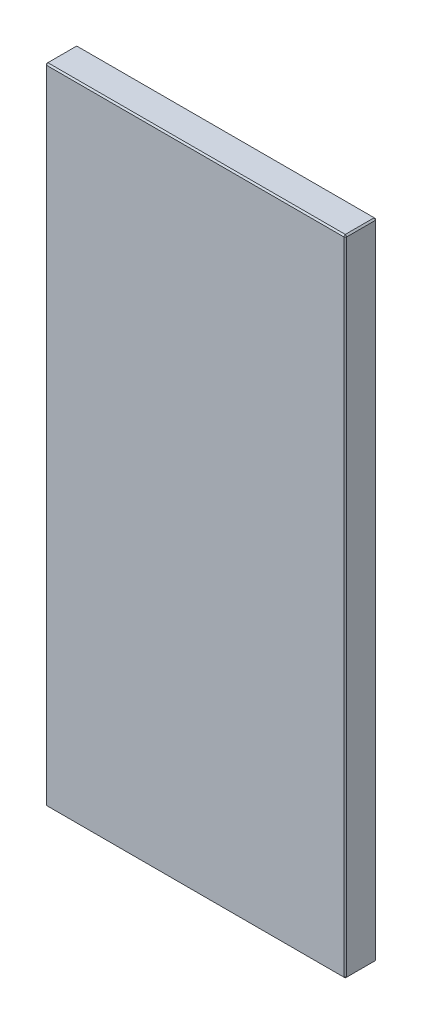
ISO-10303-21;
HEADER;
FILE_DESCRIPTION(('STEP AP214'),'2;1');
FILE_NAME('part.step','',(''),(''),'','','');
FILE_SCHEMA(('AUTOMOTIVE_DESIGN { 1 0 10303 214 1 1 1 1 }'));
ENDSEC;
DATA;
#1=APPLICATION_CONTEXT('core data for automotive mechanical design processes');
#2=APPLICATION_PROTOCOL_DEFINITION('international standard','automotive_design',2000,#1);
#3=PRODUCT_CONTEXT('',#1,'mechanical');
#4=PRODUCT('Part','Part','',(#3));
#5=PRODUCT_RELATED_PRODUCT_CATEGORY('part','',(#4));
#6=PRODUCT_DEFINITION_FORMATION('','',#4);
#7=PRODUCT_DEFINITION_CONTEXT('part definition',#1,'design');
#8=PRODUCT_DEFINITION('design','',#6,#7);
#9=PRODUCT_DEFINITION_SHAPE('','',#8);
#10=(LENGTH_UNIT() NAMED_UNIT(*) SI_UNIT(.MILLI.,.METRE.));
#11=(NAMED_UNIT(*) PLANE_ANGLE_UNIT() SI_UNIT($,.RADIAN.));
#12=(NAMED_UNIT(*) SI_UNIT($,.STERADIAN.) SOLID_ANGLE_UNIT());
#13=UNCERTAINTY_MEASURE_WITH_UNIT(LENGTH_MEASURE(1.E-05),#10,'distance_accuracy_value','');
#14=(GEOMETRIC_REPRESENTATION_CONTEXT(3) GLOBAL_UNCERTAINTY_ASSIGNED_CONTEXT((#13)) GLOBAL_UNIT_ASSIGNED_CONTEXT((#10,
#11,#12)) REPRESENTATION_CONTEXT('',''));
#15=CARTESIAN_POINT('',(0.,0.,0.));
#16=DIRECTION('',(0.,0.,1.));
#17=DIRECTION('',(1.,0.,0.));
#18=AXIS2_PLACEMENT_3D('',#15,#16,#17);
#19=CARTESIAN_POINT('',(-104.,-223.,22.));
#20=DIRECTION('',(1.,0.,0.));
#21=DIRECTION('',(0.,0.,-1.));
#22=AXIS2_PLACEMENT_3D('',#19,#20,#21);
#23=PLANE('',#22);
#24=DIRECTION('',(0.,0.,-1.));
#25=VECTOR('',#24,1.);
#26=CARTESIAN_POINT('',(-104.,222.,22.));
#27=LINE('',#26,#25);
#28=CARTESIAN_POINT('',(-104.,222.,21.));
#29=VERTEX_POINT('',#28);
#30=CARTESIAN_POINT('',(-104.,222.,1.00000000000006));
#31=VERTEX_POINT('',#30);
#32=EDGE_CURVE('E114',#29,#31,#27,.T.);
#33=ORIENTED_EDGE('',*,*,#32,.T.);
#34=DIRECTION('',(0.,-1.,0.));
#35=VECTOR('',#34,1.);
#36=CARTESIAN_POINT('',(-104.,-223.,1.00000000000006));
#37=LINE('',#36,#35);
#38=CARTESIAN_POINT('',(-104.,-222.,1.00000000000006));
#39=VERTEX_POINT('',#38);
#40=EDGE_CURVE('E110',#31,#39,#37,.T.);
#41=ORIENTED_EDGE('',*,*,#40,.T.);
#42=DIRECTION('',(0.,0.,1.));
#43=VECTOR('',#42,1.);
#44=CARTESIAN_POINT('',(-104.,-222.,22.));
#45=LINE('',#44,#43);
#46=CARTESIAN_POINT('',(-104.,-222.,21.));
#47=VERTEX_POINT('',#46);
#48=EDGE_CURVE('E103',#39,#47,#45,.T.);
#49=ORIENTED_EDGE('',*,*,#48,.T.);
#50=DIRECTION('',(0.,1.,0.));
#51=VECTOR('',#50,1.);
#52=CARTESIAN_POINT('',(-104.,223.,21.));
#53=LINE('',#52,#51);
#54=EDGE_CURVE('E107',#47,#29,#53,.T.);
#55=ORIENTED_EDGE('',*,*,#54,.T.);
#56=EDGE_LOOP('',(#33,#41,#49,#55));
#57=FACE_BOUND('',#56,.T.);
#58=ADVANCED_FACE('F15',(#57),#23,.F.);
#59=CARTESIAN_POINT('',(104.,-223.,22.));
#60=DIRECTION('',(0.,1.,0.));
#61=DIRECTION('',(-1.,0.,0.));
#62=AXIS2_PLACEMENT_3D('',#59,#60,#61);
#63=PLANE('',#62);
#64=DIRECTION('',(0.,0.,-1.));
#65=VECTOR('',#64,1.);
#66=CARTESIAN_POINT('',(-103.,-223.,22.));
#67=LINE('',#66,#65);
#68=CARTESIAN_POINT('',(-103.,-223.,21.));
#69=VERTEX_POINT('',#68);
#70=CARTESIAN_POINT('',(-103.,-223.,1.00000000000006));
#71=VERTEX_POINT('',#70);
#72=EDGE_CURVE('E122',#69,#71,#67,.T.);
#73=ORIENTED_EDGE('',*,*,#72,.T.);
#74=DIRECTION('',(1.,0.,0.));
#75=VECTOR('',#74,1.);
#76=CARTESIAN_POINT('',(104.,-223.,1.00000000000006));
#77=LINE('',#76,#75);
#78=CARTESIAN_POINT('',(103.,-223.,1.00000000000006));
#79=VERTEX_POINT('',#78);
#80=EDGE_CURVE('E160',#71,#79,#77,.T.);
#81=ORIENTED_EDGE('',*,*,#80,.T.);
#82=DIRECTION('',(0.,0.,1.));
#83=VECTOR('',#82,1.);
#84=CARTESIAN_POINT('',(103.,-223.,22.));
#85=LINE('',#84,#83);
#86=CARTESIAN_POINT('',(103.,-223.,21.));
#87=VERTEX_POINT('',#86);
#88=EDGE_CURVE('E157',#79,#87,#85,.T.);
#89=ORIENTED_EDGE('',*,*,#88,.T.);
#90=DIRECTION('',(-1.,0.,0.));
#91=VECTOR('',#90,1.);
#92=CARTESIAN_POINT('',(-104.,-223.,21.));
#93=LINE('',#92,#91);
#94=EDGE_CURVE('E155',#87,#69,#93,.T.);
#95=ORIENTED_EDGE('',*,*,#94,.T.);
#96=EDGE_LOOP('',(#73,#81,#89,#95));
#97=FACE_BOUND('',#96,.T.);
#98=ADVANCED_FACE('F277',(#97),#63,.F.);
#99=CARTESIAN_POINT('',(104.,-223.,22.));
#100=DIRECTION('',(-1.,0.,0.));
#101=DIRECTION('',(0.,0.,1.));
#102=AXIS2_PLACEMENT_3D('',#99,#100,#101);
#103=PLANE('',#102);
#104=DIRECTION('',(0.,-1.,0.));
#105=VECTOR('',#104,1.);
#106=CARTESIAN_POINT('',(104.,-223.,21.));
#107=LINE('',#106,#105);
#108=CARTESIAN_POINT('',(104.,222.,21.));
#109=VERTEX_POINT('',#108);
#110=CARTESIAN_POINT('',(104.,-222.,21.));
#111=VERTEX_POINT('',#110);
#112=EDGE_CURVE('E162',#109,#111,#107,.T.);
#113=ORIENTED_EDGE('',*,*,#112,.T.);
#114=DIRECTION('',(0.,0.,-1.));
#115=VECTOR('',#114,1.);
#116=CARTESIAN_POINT('',(104.,-222.,22.));
#117=LINE('',#116,#115);
#118=CARTESIAN_POINT('',(104.,-222.,1.00000000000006));
#119=VERTEX_POINT('',#118);
#120=EDGE_CURVE('E168',#111,#119,#117,.T.);
#121=ORIENTED_EDGE('',*,*,#120,.T.);
#122=DIRECTION('',(0.,1.,0.));
#123=VECTOR('',#122,1.);
#124=CARTESIAN_POINT('',(104.,-223.,1.00000000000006));
#125=LINE('',#124,#123);
#126=CARTESIAN_POINT('',(104.,222.,1.00000000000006));
#127=VERTEX_POINT('',#126);
#128=EDGE_CURVE('E166',#119,#127,#125,.T.);
#129=ORIENTED_EDGE('',*,*,#128,.T.);
#130=DIRECTION('',(0.,0.,1.));
#131=VECTOR('',#130,1.);
#132=CARTESIAN_POINT('',(104.,222.,22.));
#133=LINE('',#132,#131);
#134=EDGE_CURVE('E164',#127,#109,#133,.T.);
#135=ORIENTED_EDGE('',*,*,#134,.T.);
#136=EDGE_LOOP('',(#113,#121,#129,#135));
#137=FACE_BOUND('',#136,.T.);
#138=ADVANCED_FACE('F254',(#137),#103,.F.);
#139=CARTESIAN_POINT('',(104.,223.,22.));
#140=DIRECTION('',(0.,-1.,0.));
#141=DIRECTION('',(1.,0.,0.));
#142=AXIS2_PLACEMENT_3D('',#139,#140,#141);
#143=PLANE('',#142);
#144=DIRECTION('',(-1.,0.,0.));
#145=VECTOR('',#144,1.);
#146=CARTESIAN_POINT('',(104.,223.,1.00000000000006));
#147=LINE('',#146,#145);
#148=CARTESIAN_POINT('',(103.,223.,1.00000000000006));
#149=VERTEX_POINT('',#148);
#150=CARTESIAN_POINT('',(-103.,223.,1.00000000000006));
#151=VERTEX_POINT('',#150);
#152=EDGE_CURVE('E150',#149,#151,#147,.T.);
#153=ORIENTED_EDGE('',*,*,#152,.T.);
#154=DIRECTION('',(0.,0.,1.));
#155=VECTOR('',#154,1.);
#156=CARTESIAN_POINT('',(-103.,223.,22.));
#157=LINE('',#156,#155);
#158=CARTESIAN_POINT('',(-103.,223.,21.));
#159=VERTEX_POINT('',#158);
#160=EDGE_CURVE('E152',#151,#159,#157,.T.);
#161=ORIENTED_EDGE('',*,*,#160,.T.);
#162=DIRECTION('',(1.,0.,0.));
#163=VECTOR('',#162,1.);
#164=CARTESIAN_POINT('',(104.,223.,21.));
#165=LINE('',#164,#163);
#166=CARTESIAN_POINT('',(103.,223.,21.));
#167=VERTEX_POINT('',#166);
#168=EDGE_CURVE('E146',#159,#167,#165,.T.);
#169=ORIENTED_EDGE('',*,*,#168,.T.);
#170=DIRECTION('',(0.,0.,-1.));
#171=VECTOR('',#170,1.);
#172=CARTESIAN_POINT('',(103.,223.,22.));
#173=LINE('',#172,#171);
#174=EDGE_CURVE('E148',#167,#149,#173,.T.);
#175=ORIENTED_EDGE('',*,*,#174,.T.);
#176=EDGE_LOOP('',(#153,#161,#169,#175));
#177=FACE_BOUND('',#176,.T.);
#178=ADVANCED_FACE('F286',(#177),#143,.F.);
#179=CARTESIAN_POINT('',(0.,0.,22.));
#180=DIRECTION('',(0.,0.,1.));
#181=DIRECTION('',(1.,0.,0.));
#182=AXIS2_PLACEMENT_3D('',#179,#180,#181);
#183=PLANE('',#182);
#184=DIRECTION('',(0.,1.,0.));
#185=VECTOR('',#184,1.);
#186=CARTESIAN_POINT('',(103.,223.,22.));
#187=LINE('',#186,#185);
#188=CARTESIAN_POINT('',(103.,-222.,22.));
#189=VERTEX_POINT('',#188);
#190=CARTESIAN_POINT('',(103.,222.,22.));
#191=VERTEX_POINT('',#190);
#192=EDGE_CURVE('E24',#189,#191,#187,.T.);
#193=ORIENTED_EDGE('',*,*,#192,.T.);
#194=DIRECTION('',(-1.,0.,0.));
#195=VECTOR('',#194,1.);
#196=CARTESIAN_POINT('',(-104.,222.,22.));
#197=LINE('',#196,#195);
#198=CARTESIAN_POINT('',(-103.,222.,22.));
#199=VERTEX_POINT('',#198);
#200=EDGE_CURVE('E9',#191,#199,#197,.T.);
#201=ORIENTED_EDGE('',*,*,#200,.T.);
#202=DIRECTION('',(0.,-1.,0.));
#203=VECTOR('',#202,1.);
#204=CARTESIAN_POINT('',(-103.,-223.,22.));
#205=LINE('',#204,#203);
#206=CARTESIAN_POINT('',(-103.,-222.,22.));
#207=VERTEX_POINT('',#206);
#208=EDGE_CURVE('E180',#199,#207,#205,.T.);
#209=ORIENTED_EDGE('',*,*,#208,.T.);
#210=DIRECTION('',(1.,0.,0.));
#211=VECTOR('',#210,1.);
#212=CARTESIAN_POINT('',(104.,-222.,22.));
#213=LINE('',#212,#211);
#214=EDGE_CURVE('E35',#207,#189,#213,.T.);
#215=ORIENTED_EDGE('',*,*,#214,.T.);
#216=EDGE_LOOP('',(#193,#201,#209,#215));
#217=FACE_BOUND('',#216,.T.);
#218=ADVANCED_FACE('F351',(#217),#183,.T.);
#219=CARTESIAN_POINT('',(0.,0.,0.));
#220=DIRECTION('',(0.,0.,1.));
#221=DIRECTION('',(1.,0.,0.));
#222=AXIS2_PLACEMENT_3D('',#219,#220,#221);
#223=PLANE('',#222);
#224=DIRECTION('',(0.,-1.,0.));
#225=VECTOR('',#224,1.);
#226=CARTESIAN_POINT('',(103.,0.,0.));
#227=LINE('',#226,#225);
#228=CARTESIAN_POINT('',(103.,222.,0.));
#229=VERTEX_POINT('',#228);
#230=CARTESIAN_POINT('',(103.,-222.,0.));
#231=VERTEX_POINT('',#230);
#232=EDGE_CURVE('E175',#229,#231,#227,.T.);
#233=ORIENTED_EDGE('',*,*,#232,.T.);
#234=DIRECTION('',(-1.,0.,0.));
#235=VECTOR('',#234,1.);
#236=CARTESIAN_POINT('',(0.,-222.,0.));
#237=LINE('',#236,#235);
#238=CARTESIAN_POINT('',(-103.,-222.,0.));
#239=VERTEX_POINT('',#238);
#240=EDGE_CURVE('E177',#231,#239,#237,.T.);
#241=ORIENTED_EDGE('',*,*,#240,.T.);
#242=DIRECTION('',(0.,1.,0.));
#243=VECTOR('',#242,1.);
#244=CARTESIAN_POINT('',(-103.,0.,0.));
#245=LINE('',#244,#243);
#246=CARTESIAN_POINT('',(-103.,222.,0.));
#247=VERTEX_POINT('',#246);
#248=EDGE_CURVE('E173',#239,#247,#245,.T.);
#249=ORIENTED_EDGE('',*,*,#248,.T.);
#250=DIRECTION('',(1.,0.,0.));
#251=VECTOR('',#250,1.);
#252=CARTESIAN_POINT('',(0.,222.,0.));
#253=LINE('',#252,#251);
#254=EDGE_CURVE('E171',#247,#229,#253,.T.);
#255=ORIENTED_EDGE('',*,*,#254,.T.);
#256=EDGE_LOOP('',(#233,#241,#249,#255));
#257=FACE_BOUND('',#256,.T.);
#258=ADVANCED_FACE('F246',(#257),#223,.F.);
#259=CARTESIAN_POINT('',(104.,-222.,22.));
#260=DIRECTION('',(-0.707106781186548,0.707106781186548,0.));
#261=DIRECTION('',(0.,0.,-1.));
#262=AXIS2_PLACEMENT_3D('',#259,#260,#261);
#263=PLANE('',#262);
#264=DIRECTION('',(-0.707106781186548,-0.707106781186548,0.));
#265=VECTOR('',#264,1.);
#266=CARTESIAN_POINT('',(103.,-223.,21.));
#267=LINE('',#266,#265);
#268=EDGE_CURVE('E19',#87,#111,#267,.F.);
#269=ORIENTED_EDGE('',*,*,#268,.F.);
#270=ORIENTED_EDGE('',*,*,#88,.F.);
#271=DIRECTION('',(0.707106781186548,0.707106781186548,0.));
#272=VECTOR('',#271,1.);
#273=CARTESIAN_POINT('',(104.,-222.,1.00000000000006));
#274=LINE('',#273,#272);
#275=EDGE_CURVE('E142',#119,#79,#274,.F.);
#276=ORIENTED_EDGE('',*,*,#275,.F.);
#277=ORIENTED_EDGE('',*,*,#120,.F.);
#278=EDGE_LOOP('',(#269,#270,#276,#277));
#279=FACE_BOUND('',#278,.T.);
#280=ADVANCED_FACE('F17',(#279),#263,.F.);
#281=CARTESIAN_POINT('',(103.,-223.,21.));
#282=DIRECTION('',(0.577350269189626,-0.577350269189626,0.577350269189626));
#283=DIRECTION('',(0.707106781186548,0.,-0.707106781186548));
#284=AXIS2_PLACEMENT_3D('',#281,#282,#283);
#285=PLANE('',#284);
#286=DIRECTION('',(0.,-0.707106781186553,-0.707106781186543));
#287=VECTOR('',#286,1.);
#288=CARTESIAN_POINT('',(103.,-223.,21.));
#289=LINE('',#288,#287);
#290=EDGE_CURVE('E227',#87,#189,#289,.F.);
#291=ORIENTED_EDGE('',*,*,#290,.F.);
#292=ORIENTED_EDGE('',*,*,#268,.T.);
#293=DIRECTION('',(-0.707106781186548,0.,0.707106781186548));
#294=VECTOR('',#293,1.);
#295=CARTESIAN_POINT('',(103.5,-222.,21.5));
#296=LINE('',#295,#294);
#297=EDGE_CURVE('E229',#189,#111,#296,.F.);
#298=ORIENTED_EDGE('',*,*,#297,.F.);
#299=EDGE_LOOP('',(#291,#292,#298));
#300=FACE_BOUND('',#299,.T.);
#301=ADVANCED_FACE('F272',(#300),#285,.T.);
#302=CARTESIAN_POINT('',(104.,-222.,1.00000000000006));
#303=DIRECTION('',(0.577350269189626,-0.577350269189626,-0.577350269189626));
#304=DIRECTION('',(-0.707106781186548,0.,-0.707106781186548));
#305=AXIS2_PLACEMENT_3D('',#302,#303,#304);
#306=PLANE('',#305);
#307=DIRECTION('',(-0.707106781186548,0.,-0.707106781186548));
#308=VECTOR('',#307,1.);
#309=CARTESIAN_POINT('',(104.,-222.,1.00000000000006));
#310=LINE('',#309,#308);
#311=EDGE_CURVE('E221',#119,#231,#310,.T.);
#312=ORIENTED_EDGE('',*,*,#311,.F.);
#313=ORIENTED_EDGE('',*,*,#275,.T.);
#314=DIRECTION('',(0.,-0.707106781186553,0.707106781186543));
#315=VECTOR('',#314,1.);
#316=CARTESIAN_POINT('',(103.,-222.5,0.500000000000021));
#317=LINE('',#316,#315);
#318=EDGE_CURVE('E224',#231,#79,#317,.T.);
#319=ORIENTED_EDGE('',*,*,#318,.F.);
#320=EDGE_LOOP('',(#312,#313,#319));
#321=FACE_BOUND('',#320,.T.);
#322=ADVANCED_FACE('F236',(#321),#306,.T.);
#323=CARTESIAN_POINT('',(103.,0.,22.));
#324=DIRECTION('',(0.707106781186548,0.,0.707106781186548));
#325=DIRECTION('',(0.,-1.,0.));
#326=AXIS2_PLACEMENT_3D('',#323,#324,#325);
#327=PLANE('',#326);
#328=ORIENTED_EDGE('',*,*,#297,.T.);
#329=ORIENTED_EDGE('',*,*,#112,.F.);
#330=DIRECTION('',(0.707106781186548,0.,-0.707106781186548));
#331=VECTOR('',#330,1.);
#332=CARTESIAN_POINT('',(104.,222.,21.));
#333=LINE('',#332,#331);
#334=EDGE_CURVE('E215',#191,#109,#333,.T.);
#335=ORIENTED_EDGE('',*,*,#334,.F.);
#336=ORIENTED_EDGE('',*,*,#192,.F.);
#337=EDGE_LOOP('',(#328,#329,#335,#336));
#338=FACE_BOUND('',#337,.T.);
#339=ADVANCED_FACE('F267',(#338),#327,.T.);
#340=CARTESIAN_POINT('',(0.,-222.,22.));
#341=DIRECTION('',(0.,-0.707106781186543,0.707106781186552));
#342=DIRECTION('',(-1.,0.,0.));
#343=AXIS2_PLACEMENT_3D('',#340,#341,#342);
#344=PLANE('',#343);
#345=ORIENTED_EDGE('',*,*,#290,.T.);
#346=ORIENTED_EDGE('',*,*,#214,.F.);
#347=DIRECTION('',(0.,0.707106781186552,0.707106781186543));
#348=VECTOR('',#347,1.);
#349=CARTESIAN_POINT('',(-103.,-222.5,21.5));
#350=LINE('',#349,#348);
#351=EDGE_CURVE('E126',#69,#207,#350,.T.);
#352=ORIENTED_EDGE('',*,*,#351,.F.);
#353=ORIENTED_EDGE('',*,*,#94,.F.);
#354=EDGE_LOOP('',(#345,#346,#352,#353));
#355=FACE_BOUND('',#354,.T.);
#356=ADVANCED_FACE('F275',(#355),#344,.T.);
#357=CARTESIAN_POINT('',(-103.,-223.,22.));
#358=DIRECTION('',(0.707106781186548,0.707106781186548,0.));
#359=DIRECTION('',(0.,0.,-1.));
#360=AXIS2_PLACEMENT_3D('',#357,#358,#359);
#361=PLANE('',#360);
#362=DIRECTION('',(0.707106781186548,-0.707106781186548,0.));
#363=VECTOR('',#362,1.);
#364=CARTESIAN_POINT('',(-103.,-223.,1.00000000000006));
#365=LINE('',#364,#363);
#366=EDGE_CURVE('E127',#71,#39,#365,.F.);
#367=ORIENTED_EDGE('',*,*,#366,.F.);
#368=ORIENTED_EDGE('',*,*,#72,.F.);
#369=DIRECTION('',(-0.707106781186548,0.707106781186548,0.));
#370=VECTOR('',#369,1.);
#371=CARTESIAN_POINT('',(-104.,-222.,21.));
#372=LINE('',#371,#370);
#373=EDGE_CURVE('E118',#47,#69,#372,.F.);
#374=ORIENTED_EDGE('',*,*,#373,.F.);
#375=ORIENTED_EDGE('',*,*,#48,.F.);
#376=EDGE_LOOP('',(#367,#368,#374,#375));
#377=FACE_BOUND('',#376,.T.);
#378=ADVANCED_FACE('F120',(#377),#361,.F.);
#379=CARTESIAN_POINT('',(104.,-223.,1.00000000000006));
#380=DIRECTION('',(0.,0.707106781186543,0.707106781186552));
#381=DIRECTION('',(1.,0.,0.));
#382=AXIS2_PLACEMENT_3D('',#379,#380,#381);
#383=PLANE('',#382);
#384=ORIENTED_EDGE('',*,*,#318,.T.);
#385=ORIENTED_EDGE('',*,*,#80,.F.);
#386=DIRECTION('',(0.,0.707106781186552,-0.707106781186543));
#387=VECTOR('',#386,1.);
#388=CARTESIAN_POINT('',(-103.,-223.,1.00000000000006));
#389=LINE('',#388,#387);
#390=EDGE_CURVE('E211',#239,#71,#389,.F.);
#391=ORIENTED_EDGE('',*,*,#390,.F.);
#392=ORIENTED_EDGE('',*,*,#240,.F.);
#393=EDGE_LOOP('',(#384,#385,#391,#392));
#394=FACE_BOUND('',#393,.T.);
#395=ADVANCED_FACE('F243',(#394),#383,.F.);
#396=CARTESIAN_POINT('',(104.,-223.,1.00000000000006));
#397=DIRECTION('',(-0.707106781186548,0.,0.707106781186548));
#398=DIRECTION('',(0.,1.,0.));
#399=AXIS2_PLACEMENT_3D('',#396,#397,#398);
#400=PLANE('',#399);
#401=ORIENTED_EDGE('',*,*,#311,.T.);
#402=ORIENTED_EDGE('',*,*,#232,.F.);
#403=DIRECTION('',(0.707106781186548,0.,0.707106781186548));
#404=VECTOR('',#403,1.);
#405=CARTESIAN_POINT('',(104.,222.,1.00000000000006));
#406=LINE('',#405,#404);
#407=EDGE_CURVE('E208',#127,#229,#406,.F.);
#408=ORIENTED_EDGE('',*,*,#407,.F.);
#409=ORIENTED_EDGE('',*,*,#128,.F.);
#410=EDGE_LOOP('',(#401,#402,#408,#409));
#411=FACE_BOUND('',#410,.T.);
#412=ADVANCED_FACE('F251',(#411),#400,.F.);
#413=CARTESIAN_POINT('',(103.,223.,22.));
#414=DIRECTION('',(-0.707106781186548,-0.707106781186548,0.));
#415=DIRECTION('',(0.,0.,-1.));
#416=AXIS2_PLACEMENT_3D('',#413,#414,#415);
#417=PLANE('',#416);
#418=DIRECTION('',(0.707106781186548,-0.707106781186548,0.));
#419=VECTOR('',#418,1.);
#420=CARTESIAN_POINT('',(104.,222.,21.));
#421=LINE('',#420,#419);
#422=EDGE_CURVE('E218',#109,#167,#421,.F.);
#423=ORIENTED_EDGE('',*,*,#422,.F.);
#424=ORIENTED_EDGE('',*,*,#134,.F.);
#425=DIRECTION('',(-0.707106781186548,0.707106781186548,0.));
#426=VECTOR('',#425,1.);
#427=CARTESIAN_POINT('',(104.,222.,1.00000000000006));
#428=LINE('',#427,#426);
#429=EDGE_CURVE('E205',#149,#127,#428,.F.);
#430=ORIENTED_EDGE('',*,*,#429,.F.);
#431=ORIENTED_EDGE('',*,*,#174,.F.);
#432=EDGE_LOOP('',(#423,#424,#430,#431));
#433=FACE_BOUND('',#432,.T.);
#434=ADVANCED_FACE('F259',(#433),#417,.F.);
#435=CARTESIAN_POINT('',(104.,222.,21.));
#436=DIRECTION('',(0.577350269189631,0.577350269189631,0.577350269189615));
#437=DIRECTION('',(-0.707106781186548,0.707106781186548,0.));
#438=AXIS2_PLACEMENT_3D('',#435,#436,#437);
#439=PLANE('',#438);
#440=ORIENTED_EDGE('',*,*,#334,.T.);
#441=ORIENTED_EDGE('',*,*,#422,.T.);
#442=DIRECTION('',(0.,-0.707106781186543,0.707106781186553));
#443=VECTOR('',#442,1.);
#444=CARTESIAN_POINT('',(103.,222.5,21.5));
#445=LINE('',#444,#443);
#446=EDGE_CURVE('E134',#191,#167,#445,.F.);
#447=ORIENTED_EDGE('',*,*,#446,.F.);
#448=EDGE_LOOP('',(#440,#441,#447));
#449=FACE_BOUND('',#448,.T.);
#450=ADVANCED_FACE('F264',(#449),#439,.T.);
#451=CARTESIAN_POINT('',(-104.,-222.,21.));
#452=DIRECTION('',(-0.577350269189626,-0.577350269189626,0.577350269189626));
#453=DIRECTION('',(0.707106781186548,0.,0.707106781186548));
#454=AXIS2_PLACEMENT_3D('',#451,#452,#453);
#455=PLANE('',#454);
#456=ORIENTED_EDGE('',*,*,#373,.T.);
#457=ORIENTED_EDGE('',*,*,#351,.T.);
#458=DIRECTION('',(-0.707106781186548,0.,-0.707106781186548));
#459=VECTOR('',#458,1.);
#460=CARTESIAN_POINT('',(-104.,-222.,21.));
#461=LINE('',#460,#459);
#462=EDGE_CURVE('E130',#47,#207,#461,.F.);
#463=ORIENTED_EDGE('',*,*,#462,.F.);
#464=EDGE_LOOP('',(#456,#457,#463));
#465=FACE_BOUND('',#464,.T.);
#466=ADVANCED_FACE('F131',(#465),#455,.T.);
#467=CARTESIAN_POINT('',(-103.,-223.,1.00000000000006));
#468=DIRECTION('',(-0.577350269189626,-0.577350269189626,-0.577350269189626));
#469=DIRECTION('',(-0.707106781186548,0.,0.707106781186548));
#470=AXIS2_PLACEMENT_3D('',#467,#468,#469);
#471=PLANE('',#470);
#472=ORIENTED_EDGE('',*,*,#390,.T.);
#473=ORIENTED_EDGE('',*,*,#366,.T.);
#474=DIRECTION('',(-0.707106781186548,0.,0.707106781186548));
#475=VECTOR('',#474,1.);
#476=CARTESIAN_POINT('',(-103.5,-222.,0.500000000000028));
#477=LINE('',#476,#475);
#478=EDGE_CURVE('E135',#239,#39,#477,.T.);
#479=ORIENTED_EDGE('',*,*,#478,.F.);
#480=EDGE_LOOP('',(#472,#473,#479));
#481=FACE_BOUND('',#480,.T.);
#482=ADVANCED_FACE('F320',(#481),#471,.T.);
#483=CARTESIAN_POINT('',(104.,222.,1.00000000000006));
#484=DIRECTION('',(0.577350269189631,0.577350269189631,-0.577350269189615));
#485=DIRECTION('',(-0.707106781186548,0.707106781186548,0.));
#486=AXIS2_PLACEMENT_3D('',#483,#484,#485);
#487=PLANE('',#486);
#488=ORIENTED_EDGE('',*,*,#429,.T.);
#489=ORIENTED_EDGE('',*,*,#407,.T.);
#490=DIRECTION('',(0.,-0.707106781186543,-0.707106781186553));
#491=VECTOR('',#490,1.);
#492=CARTESIAN_POINT('',(103.,222.5,0.500000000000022));
#493=LINE('',#492,#491);
#494=EDGE_CURVE('E198',#149,#229,#493,.T.);
#495=ORIENTED_EDGE('',*,*,#494,.F.);
#496=EDGE_LOOP('',(#488,#489,#495));
#497=FACE_BOUND('',#496,.T.);
#498=ADVANCED_FACE('F316',(#497),#487,.T.);
#499=CARTESIAN_POINT('',(0.,222.,22.));
#500=DIRECTION('',(0.,0.707106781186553,0.707106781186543));
#501=DIRECTION('',(1.,0.,0.));
#502=AXIS2_PLACEMENT_3D('',#499,#500,#501);
#503=PLANE('',#502);
#504=ORIENTED_EDGE('',*,*,#446,.T.);
#505=ORIENTED_EDGE('',*,*,#168,.F.);
#506=DIRECTION('',(0.,0.707106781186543,-0.707106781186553));
#507=VECTOR('',#506,1.);
#508=CARTESIAN_POINT('',(-103.,223.,21.));
#509=LINE('',#508,#507);
#510=EDGE_CURVE('E195',#199,#159,#509,.T.);
#511=ORIENTED_EDGE('',*,*,#510,.F.);
#512=ORIENTED_EDGE('',*,*,#200,.F.);
#513=EDGE_LOOP('',(#504,#505,#511,#512));
#514=FACE_BOUND('',#513,.T.);
#515=ADVANCED_FACE('F313',(#514),#503,.T.);
#516=CARTESIAN_POINT('',(-103.,0.,22.));
#517=DIRECTION('',(-0.707106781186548,0.,0.707106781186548));
#518=DIRECTION('',(0.,1.,0.));
#519=AXIS2_PLACEMENT_3D('',#516,#517,#518);
#520=PLANE('',#519);
#521=ORIENTED_EDGE('',*,*,#462,.T.);
#522=ORIENTED_EDGE('',*,*,#208,.F.);
#523=DIRECTION('',(0.707106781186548,0.,0.707106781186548));
#524=VECTOR('',#523,1.);
#525=CARTESIAN_POINT('',(-103.5,222.,21.5));
#526=LINE('',#525,#524);
#527=EDGE_CURVE('E138',#29,#199,#526,.T.);
#528=ORIENTED_EDGE('',*,*,#527,.F.);
#529=ORIENTED_EDGE('',*,*,#54,.F.);
#530=EDGE_LOOP('',(#521,#522,#528,#529));
#531=FACE_BOUND('',#530,.T.);
#532=ADVANCED_FACE('F137',(#531),#520,.T.);
#533=CARTESIAN_POINT('',(-104.,-223.,1.00000000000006));
#534=DIRECTION('',(0.707106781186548,0.,0.707106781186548));
#535=DIRECTION('',(0.,-1.,0.));
#536=AXIS2_PLACEMENT_3D('',#533,#534,#535);
#537=PLANE('',#536);
#538=ORIENTED_EDGE('',*,*,#478,.T.);
#539=ORIENTED_EDGE('',*,*,#40,.F.);
#540=DIRECTION('',(0.707106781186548,0.,-0.707106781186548));
#541=VECTOR('',#540,1.);
#542=CARTESIAN_POINT('',(-104.,222.,1.00000000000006));
#543=LINE('',#542,#541);
#544=EDGE_CURVE('E191',#247,#31,#543,.F.);
#545=ORIENTED_EDGE('',*,*,#544,.F.);
#546=ORIENTED_EDGE('',*,*,#248,.F.);
#547=EDGE_LOOP('',(#538,#539,#545,#546));
#548=FACE_BOUND('',#547,.T.);
#549=ADVANCED_FACE('F306',(#548),#537,.F.);
#550=CARTESIAN_POINT('',(104.,223.,1.00000000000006));
#551=DIRECTION('',(0.,-0.707106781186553,0.707106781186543));
#552=DIRECTION('',(-1.,0.,0.));
#553=AXIS2_PLACEMENT_3D('',#550,#551,#552);
#554=PLANE('',#553);
#555=ORIENTED_EDGE('',*,*,#494,.T.);
#556=ORIENTED_EDGE('',*,*,#254,.F.);
#557=DIRECTION('',(0.,0.707106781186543,0.707106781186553));
#558=VECTOR('',#557,1.);
#559=CARTESIAN_POINT('',(-103.,222.5,0.500000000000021));
#560=LINE('',#559,#558);
#561=EDGE_CURVE('E188',#151,#247,#560,.F.);
#562=ORIENTED_EDGE('',*,*,#561,.F.);
#563=ORIENTED_EDGE('',*,*,#152,.F.);
#564=EDGE_LOOP('',(#555,#556,#562,#563));
#565=FACE_BOUND('',#564,.T.);
#566=ADVANCED_FACE('F302',(#565),#554,.F.);
#567=CARTESIAN_POINT('',(-103.,223.,21.));
#568=DIRECTION('',(-0.577350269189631,0.577350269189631,0.577350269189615));
#569=DIRECTION('',(-0.707106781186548,-0.707106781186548,0.));
#570=AXIS2_PLACEMENT_3D('',#567,#568,#569);
#571=PLANE('',#570);
#572=ORIENTED_EDGE('',*,*,#527,.T.);
#573=ORIENTED_EDGE('',*,*,#510,.T.);
#574=DIRECTION('',(0.707106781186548,0.707106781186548,0.));
#575=VECTOR('',#574,1.);
#576=CARTESIAN_POINT('',(-103.,223.,21.));
#577=LINE('',#576,#575);
#578=EDGE_CURVE('E186',#29,#159,#577,.T.);
#579=ORIENTED_EDGE('',*,*,#578,.F.);
#580=EDGE_LOOP('',(#572,#573,#579));
#581=FACE_BOUND('',#580,.T.);
#582=ADVANCED_FACE('F298',(#581),#571,.T.);
#583=CARTESIAN_POINT('',(-104.,222.,1.00000000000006));
#584=DIRECTION('',(-0.577350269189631,0.577350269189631,-0.577350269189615));
#585=DIRECTION('',(-0.707106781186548,-0.707106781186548,0.));
#586=AXIS2_PLACEMENT_3D('',#583,#584,#585);
#587=PLANE('',#586);
#588=ORIENTED_EDGE('',*,*,#561,.T.);
#589=ORIENTED_EDGE('',*,*,#544,.T.);
#590=DIRECTION('',(-0.707106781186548,-0.707106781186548,0.));
#591=VECTOR('',#590,1.);
#592=CARTESIAN_POINT('',(-104.,222.,1.00000000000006));
#593=LINE('',#592,#591);
#594=EDGE_CURVE('E184',#151,#31,#593,.T.);
#595=ORIENTED_EDGE('',*,*,#594,.F.);
#596=EDGE_LOOP('',(#588,#589,#595));
#597=FACE_BOUND('',#596,.T.);
#598=ADVANCED_FACE('F294',(#597),#587,.T.);
#599=CARTESIAN_POINT('',(-104.,222.,22.));
#600=DIRECTION('',(0.707106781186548,-0.707106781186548,0.));
#601=DIRECTION('',(0.,0.,-1.));
#602=AXIS2_PLACEMENT_3D('',#599,#600,#601);
#603=PLANE('',#602);
#604=ORIENTED_EDGE('',*,*,#578,.T.);
#605=ORIENTED_EDGE('',*,*,#160,.F.);
#606=ORIENTED_EDGE('',*,*,#594,.T.);
#607=ORIENTED_EDGE('',*,*,#32,.F.);
#608=EDGE_LOOP('',(#604,#605,#606,#607));
#609=FACE_BOUND('',#608,.T.);
#610=ADVANCED_FACE('F291',(#609),#603,.F.);
#611=CLOSED_SHELL('',(#58,#98,#138,#178,#218,#258,#280,#301,#322,#339,#356,#378,#395,#412,#434,
#450,#466,#482,#498,#515,#532,#549,#566,#582,#598,#610));
#612=MANIFOLD_SOLID_BREP('B1',#611);
#613=ADVANCED_BREP_SHAPE_REPRESENTATION('',(#18,#612),#14);
#614=SHAPE_DEFINITION_REPRESENTATION(#9,#613);
ENDSEC;
END-ISO-10303-21;
